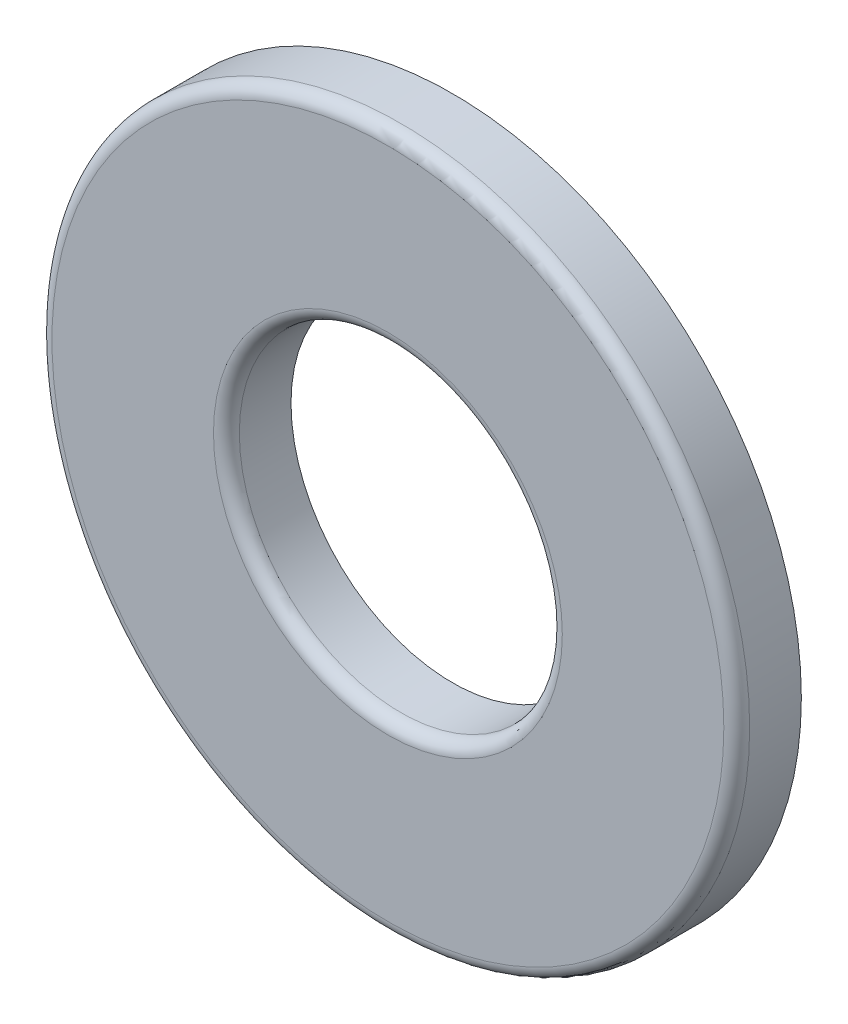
from build123d import *

# Parameters (mm, degrees)
ESQUISSE1_R          = 13.5
ESQUISSE1_R_2        = 6.25
BASE_EXTRUSION_DEPTH = 2.5
CONG_1_R             = 0.5


with BuildPart() as part:
    # Esquisse1 → Base-Extrusion (new body)
    with BuildSketch(Plane.XY):
        Circle(ESQUISSE1_R)
        Circle(ESQUISSE1_R_2, mode=Mode.SUBTRACT)
    extrude(amount=BASE_EXTRUSION_DEPTH)

    # Cong_1
    cong_1_edges = [part.edges().sort_by_distance(p)[0] for p in [
        (-13.5, 0, 2.5),
        (-6.25, 0, 2.5),
    ]]
    fillet(cong_1_edges, radius=CONG_1_R)


solid = part.part
